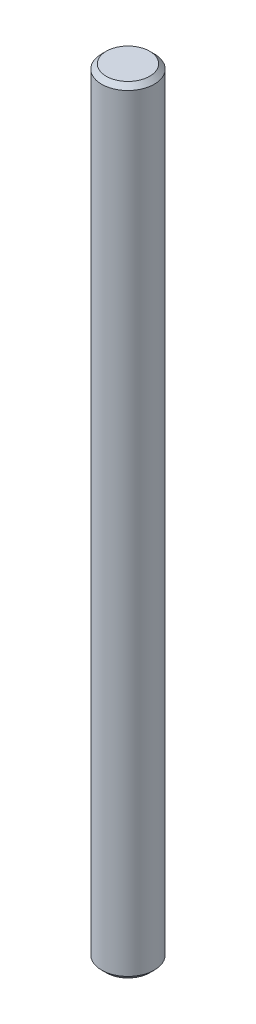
ISO-10303-21;
HEADER;
FILE_DESCRIPTION(('STEP AP214'),'2;1');
FILE_NAME('part.step','',(''),(''),'','','');
FILE_SCHEMA(('AUTOMOTIVE_DESIGN { 1 0 10303 214 1 1 1 1 }'));
ENDSEC;
DATA;
#1=APPLICATION_CONTEXT('core data for automotive mechanical design processes');
#2=APPLICATION_PROTOCOL_DEFINITION('international standard','automotive_design',2000,#1);
#3=PRODUCT_CONTEXT('',#1,'mechanical');
#4=PRODUCT('Part','Part','',(#3));
#5=PRODUCT_RELATED_PRODUCT_CATEGORY('part','',(#4));
#6=PRODUCT_DEFINITION_FORMATION('','',#4);
#7=PRODUCT_DEFINITION_CONTEXT('part definition',#1,'design');
#8=PRODUCT_DEFINITION('design','',#6,#7);
#9=PRODUCT_DEFINITION_SHAPE('','',#8);
#10=(LENGTH_UNIT() NAMED_UNIT(*) SI_UNIT(.MILLI.,.METRE.));
#11=(NAMED_UNIT(*) PLANE_ANGLE_UNIT() SI_UNIT($,.RADIAN.));
#12=(NAMED_UNIT(*) SI_UNIT($,.STERADIAN.) SOLID_ANGLE_UNIT());
#13=UNCERTAINTY_MEASURE_WITH_UNIT(LENGTH_MEASURE(1.E-05),#10,'distance_accuracy_value','');
#14=(GEOMETRIC_REPRESENTATION_CONTEXT(3) GLOBAL_UNCERTAINTY_ASSIGNED_CONTEXT((#13)) GLOBAL_UNIT_ASSIGNED_CONTEXT((#10,
#11,#12)) REPRESENTATION_CONTEXT('',''));
#15=CARTESIAN_POINT('',(0.,0.,0.));
#16=DIRECTION('',(0.,0.,1.));
#17=DIRECTION('',(1.,0.,0.));
#18=AXIS2_PLACEMENT_3D('',#15,#16,#17);
#19=CARTESIAN_POINT('',(0.,59.,0.));
#20=DIRECTION('',(0.,-1.,0.));
#21=DIRECTION('',(0.,0.,-1.));
#22=AXIS2_PLACEMENT_3D('',#19,#20,#21);
#23=CYLINDRICAL_SURFACE('',#22,2.);
#24=CARTESIAN_POINT('',(0.,0.349999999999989,0.));
#25=DIRECTION('',(0.,1.,0.));
#26=DIRECTION('',(0.,0.,1.));
#27=AXIS2_PLACEMENT_3D('',#24,#25,#26);
#28=CIRCLE('',#27,2.);
#29=CARTESIAN_POINT('',(0.,0.349999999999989,2.));
#30=VERTEX_POINT('',#29);
#31=EDGE_CURVE('E40',#30,#30,#28,.T.);
#32=ORIENTED_EDGE('',*,*,#31,.T.);
#33=EDGE_LOOP('',(#32));
#34=FACE_BOUND('',#33,.T.);
#35=CARTESIAN_POINT('',(0.,58.65,0.));
#36=DIRECTION('',(0.,1.,0.));
#37=DIRECTION('',(0.,0.,1.));
#38=AXIS2_PLACEMENT_3D('',#35,#36,#37);
#39=CIRCLE('',#38,2.);
#40=CARTESIAN_POINT('',(0.,58.65,2.));
#41=VERTEX_POINT('',#40);
#42=EDGE_CURVE('E44',#41,#41,#39,.F.);
#43=ORIENTED_EDGE('',*,*,#42,.T.);
#44=EDGE_LOOP('',(#43));
#45=FACE_BOUND('',#44,.T.);
#46=ADVANCED_FACE('F29',(#34,#45),#23,.T.);
#47=CARTESIAN_POINT('',(0.,59.,0.));
#48=DIRECTION('',(0.,1.,0.));
#49=DIRECTION('',(0.,0.,1.));
#50=AXIS2_PLACEMENT_3D('',#47,#48,#49);
#51=PLANE('',#50);
#52=CARTESIAN_POINT('',(0.,59.,0.));
#53=DIRECTION('',(0.,1.,0.));
#54=DIRECTION('',(0.,0.,1.));
#55=AXIS2_PLACEMENT_3D('',#52,#53,#54);
#56=CIRCLE('',#55,1.65);
#57=CARTESIAN_POINT('',(0.,59.,1.65));
#58=VERTEX_POINT('',#57);
#59=EDGE_CURVE('E10',#58,#58,#56,.T.);
#60=ORIENTED_EDGE('',*,*,#59,.T.);
#61=EDGE_LOOP('',(#60));
#62=FACE_BOUND('',#61,.T.);
#63=ADVANCED_FACE('F60',(#62),#51,.T.);
#64=CARTESIAN_POINT('',(0.,0.,0.));
#65=DIRECTION('',(0.,1.,0.));
#66=DIRECTION('',(0.,0.,1.));
#67=AXIS2_PLACEMENT_3D('',#64,#65,#66);
#68=PLANE('',#67);
#69=CARTESIAN_POINT('',(0.,0.,0.));
#70=DIRECTION('',(0.,1.,0.));
#71=DIRECTION('',(0.,0.,1.));
#72=AXIS2_PLACEMENT_3D('',#69,#70,#71);
#73=CIRCLE('',#72,1.65000000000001);
#74=CARTESIAN_POINT('',(0.,0.,1.65000000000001));
#75=VERTEX_POINT('',#74);
#76=EDGE_CURVE('E36',#75,#75,#73,.F.);
#77=ORIENTED_EDGE('',*,*,#76,.T.);
#78=EDGE_LOOP('',(#77));
#79=FACE_BOUND('',#78,.T.);
#80=ADVANCED_FACE('F57',(#79),#68,.F.);
#81=CARTESIAN_POINT('',(0.,0.349999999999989,0.));
#82=DIRECTION('',(0.,1.,0.));
#83=DIRECTION('',(0.,0.,1.));
#84=AXIS2_PLACEMENT_3D('',#81,#82,#83);
#85=CONICAL_SURFACE('',#84,2.,0.785398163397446);
#86=ORIENTED_EDGE('',*,*,#76,.F.);
#87=EDGE_LOOP('',(#86));
#88=FACE_BOUND('',#87,.T.);
#89=ORIENTED_EDGE('',*,*,#31,.F.);
#90=EDGE_LOOP('',(#89));
#91=FACE_BOUND('',#90,.T.);
#92=ADVANCED_FACE('F53',(#88,#91),#85,.T.);
#93=CARTESIAN_POINT('',(0.,59.,0.));
#94=DIRECTION('',(0.,-1.,0.));
#95=DIRECTION('',(0.,0.,-1.));
#96=AXIS2_PLACEMENT_3D('',#93,#94,#95);
#97=CONICAL_SURFACE('',#96,1.65,0.785398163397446);
#98=ORIENTED_EDGE('',*,*,#42,.F.);
#99=EDGE_LOOP('',(#98));
#100=FACE_BOUND('',#99,.T.);
#101=ORIENTED_EDGE('',*,*,#59,.F.);
#102=EDGE_LOOP('',(#101));
#103=FACE_BOUND('',#102,.T.);
#104=ADVANCED_FACE('F31',(#100,#103),#97,.T.);
#105=CLOSED_SHELL('',(#46,#63,#80,#92,#104));
#106=MANIFOLD_SOLID_BREP('B2',#105);
#107=ADVANCED_BREP_SHAPE_REPRESENTATION('',(#18,#106),#14);
#108=SHAPE_DEFINITION_REPRESENTATION(#9,#107);
ENDSEC;
END-ISO-10303-21;
